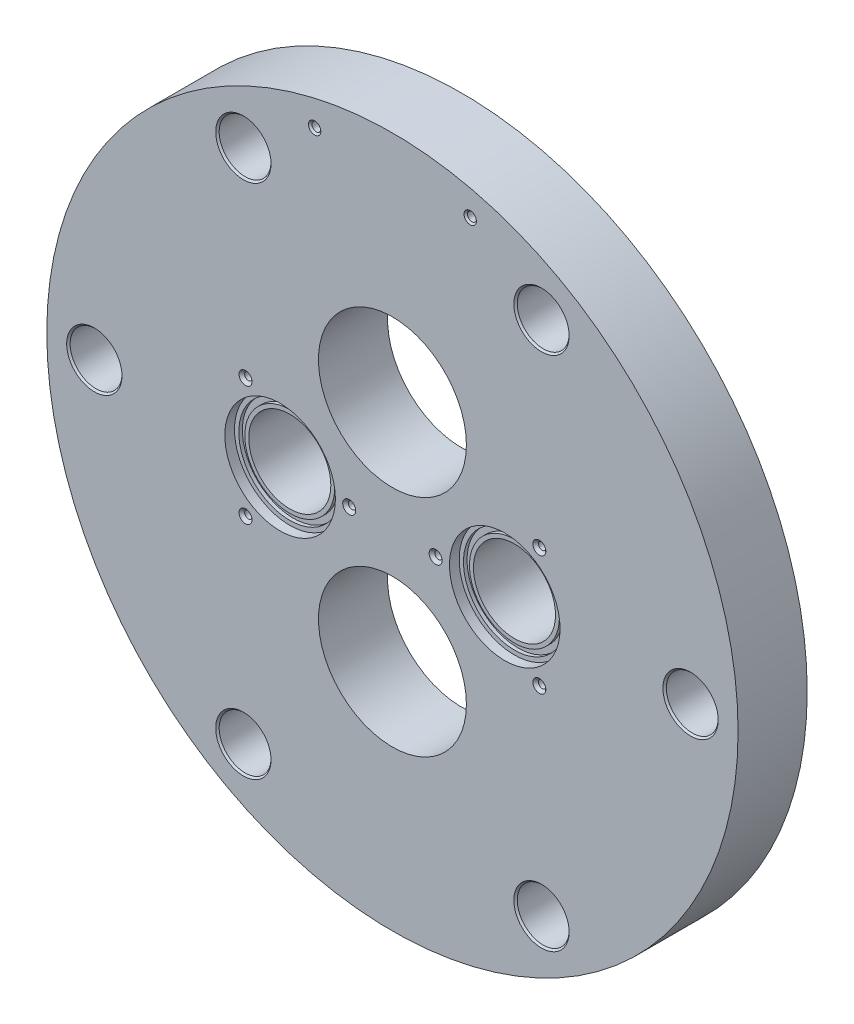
from build123d import *

# Parameters (mm, degrees)
SKETCH1_R                                      = 127
DIA_10_X_1_THICK_EXTRUSION_DEPTH               = 25.4
ADJUSTABLE_MOUNTING_HOLES_0_500_D              = 19.05
ADJUSTABLE_MOUNTING_HOLES_0_500_CSINK_D        = 20.32
ADJUSTABLE_MOUNTING_HOLES_0_500_CSINK_ANGLE    = 90
SKETCH4_R                                      = 27.178
STELLER_TUBE_THRU_HOLES_DEPTH                  = 182.392282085
METROLOGY_BEAM_THRU_HOLE_1_1875_IN_DEPTH       = 182.392282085
METROLOGY_BEAM_THRU_HOLE_1_1875_IN_DEPTH_BACK  = 182.392282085
SKETCH6_R                                      = 15.08125
SKETCH7_R                                      = 20.32
METROLOGY_WINDOW_RECESS_DEPTH                  = 3.556
LEFT_METROLOGY_WINDOW_SCREWS_6_32_D            = 2.7051
LEFT_METROLOGY_WINDOW_SCREWS_6_32_DEPTH        = 10.36330597
LEFT_METROLOGY_WINDOW_SCREWS_6_32_CSINK_D      = 4.7752
LEFT_METROLOGY_WINDOW_SCREWS_6_32_CSINK_ANGLE  = 90
LEFT_METROLOGY_WINDOW_SCREWS_6_32_TIP          = 0.81269403
RIGHT_METROLOGY_WINDOW_SCREWS_6_32_D           = 2.7051
RIGHT_METROLOGY_WINDOW_SCREWS_6_32_DEPTH       = 10.36330597
RIGHT_METROLOGY_WINDOW_SCREWS_6_32_CSINK_D     = 4.7752
RIGHT_METROLOGY_WINDOW_SCREWS_6_32_CSINK_ANGLE = 90
RIGHT_METROLOGY_WINDOW_SCREWS_6_32_TIP         = 0.81269403
SKETCH13_R                                     = 99.1362
SKETCH13_R_2                                   = 95.0468
O_RING_2_264_GLAND_DEPTH                       = 2.6416
F_8_32_TAPPED_HOLE1_D                          = 3.4544
F_8_32_TAPPED_HOLE1_DEPTH                      = 14.049793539
F_8_32_TAPPED_HOLE1_CSINK_D                    = 5.4356
F_8_32_TAPPED_HOLE1_CSINK_ANGLE                = 90
F_8_32_TAPPED_HOLE1_TIP                        = 1.037806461
SKETCH17_R                                     = 18.7325
SKETCH17_R_2                                   = 16.5227
O_RING_2_027_GLAND_DEPTH                       = 1.3208
F_30_0_1285_DIAMETER_HOLE1_D                   = 3.2639
F_30_0_1285_DIAMETER_HOLE1_CSINK_D             = 4.5339
F_30_0_1285_DIAMETER_HOLE1_CSINK_ANGLE         = 90


with BuildPart() as part:
    # Sketch1 → Dia_10_ X 1_ Thick Extrusion (new body)
    with BuildSketch(Plane.XY):
        Circle(SKETCH1_R)
    extrude(amount=DIA_10_X_1_THICK_EXTRUSION_DEPTH)

    # Adjustable Mounting Holes _0.500 (through all)
    with Locations(Plane.XY.offset(25.4)):
        with Locations((-109.5375, 0), (-54.76875, 94.862257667), (54.76875, 94.862257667), (109.5375, 0), (54.76875, -94.862257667), (-54.76875, -94.862257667)):
            CounterSinkHole(ADJUSTABLE_MOUNTING_HOLES_0_500_D / 2, ADJUSTABLE_MOUNTING_HOLES_0_500_CSINK_D / 2, counter_sink_angle=ADJUSTABLE_MOUNTING_HOLES_0_500_CSINK_ANGLE)

    # Sketch4 → Steller Tube Thru Holes (cut, through all)
    with BuildSketch(Plane.XY.offset(25.4)):
        with Locations((0, 41.275)):
            Circle(SKETCH4_R)
        with Locations((0, -41.275)):
            Circle(SKETCH4_R)
    extrude(amount=-STELLER_TUBE_THRU_HOLES_DEPTH, mode=Mode.SUBTRACT)

    # Sketch6 → Metrology Beam Thru Hole _1.1875 in (cut, two sides: drawn at the far end of the back side and taken through both)
    with BuildSketch(Plane.XY.offset(25.4).offset(-METROLOGY_BEAM_THRU_HOLE_1_1875_IN_DEPTH_BACK)):
        with Locations((41.275, 0)):
            Circle(SKETCH6_R)
        with Locations((-41.275, 0)):
            Circle(SKETCH6_R)
    extrude(amount=METROLOGY_BEAM_THRU_HOLE_1_1875_IN_DEPTH + METROLOGY_BEAM_THRU_HOLE_1_1875_IN_DEPTH_BACK, mode=Mode.SUBTRACT)

    # Sketch7 → Metrology Window Recess (cut)
    with BuildSketch(Plane.XY.offset(25.4)):
        with Locations((-41.275, 0)):
            Circle(SKETCH7_R)
        with Locations((41.275, 0)):
            Circle(SKETCH7_R)
    extrude(amount=-METROLOGY_WINDOW_RECESS_DEPTH, mode=Mode.SUBTRACT)

    # Left Metrology Window Screws _6-32
    with Locations(Plane.XY.offset(25.4)):
        with Locations((-15.875, 0), (-53.975, -21.997045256), (-53.975, 21.997045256)):
            CounterSinkHole(LEFT_METROLOGY_WINDOW_SCREWS_6_32_D / 2, LEFT_METROLOGY_WINDOW_SCREWS_6_32_CSINK_D / 2, depth=LEFT_METROLOGY_WINDOW_SCREWS_6_32_DEPTH, counter_sink_angle=LEFT_METROLOGY_WINDOW_SCREWS_6_32_CSINK_ANGLE)
            with Locations((0, 0, -(LEFT_METROLOGY_WINDOW_SCREWS_6_32_DEPTH + LEFT_METROLOGY_WINDOW_SCREWS_6_32_TIP / 2))):  # 118° drill point
                Cone(0, LEFT_METROLOGY_WINDOW_SCREWS_6_32_D / 2, LEFT_METROLOGY_WINDOW_SCREWS_6_32_TIP, mode=Mode.SUBTRACT)

    # Right Metrology Window Screws _6-32
    with Locations(Plane.XY.offset(25.4)):
        with Locations((15.875, 0), (53.975, 21.997045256), (53.975, -21.997045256)):
            CounterSinkHole(RIGHT_METROLOGY_WINDOW_SCREWS_6_32_D / 2, RIGHT_METROLOGY_WINDOW_SCREWS_6_32_CSINK_D / 2, depth=RIGHT_METROLOGY_WINDOW_SCREWS_6_32_DEPTH, counter_sink_angle=RIGHT_METROLOGY_WINDOW_SCREWS_6_32_CSINK_ANGLE)
            with Locations((0, 0, -(RIGHT_METROLOGY_WINDOW_SCREWS_6_32_DEPTH + RIGHT_METROLOGY_WINDOW_SCREWS_6_32_TIP / 2))):  # 118° drill point
                Cone(0, RIGHT_METROLOGY_WINDOW_SCREWS_6_32_D / 2, RIGHT_METROLOGY_WINDOW_SCREWS_6_32_TIP, mode=Mode.SUBTRACT)

    # Sketch13 → O-Ring _2-264 Gland (cut)
    with BuildSketch(Plane(origin=(0, 0, 0), x_dir=(-1, 0, 0), z_dir=(0, 0, -1))):
        Circle(SKETCH13_R)
        Circle(SKETCH13_R_2, mode=Mode.SUBTRACT)
    extrude(amount=-O_RING_2_264_GLAND_DEPTH, mode=Mode.SUBTRACT)

    # 8-32 Tapped Hole1
    with Locations(Plane(origin=(0, 0, 0), x_dir=(-1, 0, 0), z_dir=(0, 0, -1))):
        with Locations((-34.925, 41.275), (-17.4625, 71.520937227), (17.4625, 71.520937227), (34.925, 41.275), (17.4625, 11.029062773), (-17.4625, 11.029062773), (-17.4625, -11.029062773), (17.4625, -11.029062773), (34.925, -41.275), (17.4625, -71.520937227), (-17.4625, -71.520937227), (-34.925, -41.275)):
            CounterSinkHole(F_8_32_TAPPED_HOLE1_D / 2, F_8_32_TAPPED_HOLE1_CSINK_D / 2, depth=F_8_32_TAPPED_HOLE1_DEPTH, counter_sink_angle=F_8_32_TAPPED_HOLE1_CSINK_ANGLE)
            with Locations((0, 0, -(F_8_32_TAPPED_HOLE1_DEPTH + F_8_32_TAPPED_HOLE1_TIP / 2))):  # 118° drill point
                Cone(0, F_8_32_TAPPED_HOLE1_D / 2, F_8_32_TAPPED_HOLE1_TIP, mode=Mode.SUBTRACT)

    # Sketch17 → O-Ring 2-027 Gland (cut)
    # profile 1 of 2: a face of its own
    with BuildSketch(Plane.XY.offset(21.844)):
        with Locations((-41.275, 0)):
            Circle(SKETCH17_R)
        with Locations((-41.275, 0)):
            Circle(SKETCH17_R_2, mode=Mode.SUBTRACT)
    # profile 2 of 2: a face of its own
    with BuildSketch(Plane.XY.offset(21.844)):
        with Locations((41.275, 0)):
            Circle(SKETCH17_R)
        with Locations((41.275, 0)):
            Circle(SKETCH17_R_2, mode=Mode.SUBTRACT)
    extrude(amount=-O_RING_2_027_GLAND_DEPTH, mode=Mode.SUBTRACT)

    # 30 _0.1285_ Diameter Hole1 (through all)
    with Locations(Plane.XY.offset(25.4)):
        with Locations((-28.575, 114.3), (28.575, 114.3)):
            CounterSinkHole(F_30_0_1285_DIAMETER_HOLE1_D / 2, F_30_0_1285_DIAMETER_HOLE1_CSINK_D / 2, counter_sink_angle=F_30_0_1285_DIAMETER_HOLE1_CSINK_ANGLE)


solid = part.part
